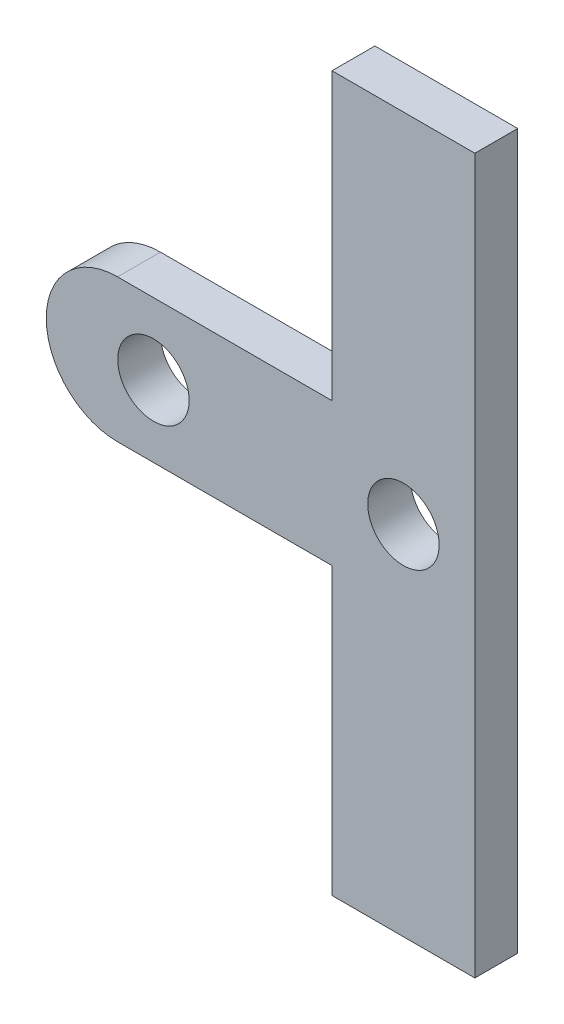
ISO-10303-21;
HEADER;
FILE_DESCRIPTION(('STEP AP214'),'2;1');
FILE_NAME('part.step','',(''),(''),'','','');
FILE_SCHEMA(('AUTOMOTIVE_DESIGN { 1 0 10303 214 1 1 1 1 }'));
ENDSEC;
DATA;
#1=APPLICATION_CONTEXT('core data for automotive mechanical design processes');
#2=APPLICATION_PROTOCOL_DEFINITION('international standard','automotive_design',2000,#1);
#3=PRODUCT_CONTEXT('',#1,'mechanical');
#4=PRODUCT('Part','Part','',(#3));
#5=PRODUCT_RELATED_PRODUCT_CATEGORY('part','',(#4));
#6=PRODUCT_DEFINITION_FORMATION('','',#4);
#7=PRODUCT_DEFINITION_CONTEXT('part definition',#1,'design');
#8=PRODUCT_DEFINITION('design','',#6,#7);
#9=PRODUCT_DEFINITION_SHAPE('','',#8);
#10=(LENGTH_UNIT() NAMED_UNIT(*) SI_UNIT(.MILLI.,.METRE.));
#11=(NAMED_UNIT(*) PLANE_ANGLE_UNIT() SI_UNIT($,.RADIAN.));
#12=(NAMED_UNIT(*) SI_UNIT($,.STERADIAN.) SOLID_ANGLE_UNIT());
#13=UNCERTAINTY_MEASURE_WITH_UNIT(LENGTH_MEASURE(1.E-05),#10,'distance_accuracy_value','');
#14=(GEOMETRIC_REPRESENTATION_CONTEXT(3) GLOBAL_UNCERTAINTY_ASSIGNED_CONTEXT((#13)) GLOBAL_UNIT_ASSIGNED_CONTEXT((#10,
#11,#12)) REPRESENTATION_CONTEXT('',''));
#15=CARTESIAN_POINT('',(0.,0.,0.));
#16=DIRECTION('',(0.,0.,1.));
#17=DIRECTION('',(1.,0.,0.));
#18=AXIS2_PLACEMENT_3D('',#15,#16,#17);
#19=CARTESIAN_POINT('',(-45.3497046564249,4.99,3.));
#20=DIRECTION('',(0.,0.,-1.));
#21=DIRECTION('',(-1.,0.,0.));
#22=AXIS2_PLACEMENT_3D('',#19,#20,#21);
#23=PLANE('',#22);
#24=CARTESIAN_POINT('',(-42.8397046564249,5.,3.));
#25=DIRECTION('',(0.,0.,1.));
#26=DIRECTION('',(1.,0.,0.));
#27=AXIS2_PLACEMENT_3D('',#24,#25,#26);
#28=CIRCLE('',#27,2.5);
#29=CARTESIAN_POINT('',(-40.3397046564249,5.,3.));
#30=VERTEX_POINT('',#29);
#31=EDGE_CURVE('E127',#30,#30,#28,.T.);
#32=ORIENTED_EDGE('',*,*,#31,.F.);
#33=EDGE_LOOP('',(#32));
#34=FACE_BOUND('',#33,.T.);
#35=DIRECTION('',(0.,-1.,0.));
#36=VECTOR('',#35,1.);
#37=CARTESIAN_POINT('',(-30.3397046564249,9.99999999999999,3.));
#38=LINE('',#37,#36);
#39=CARTESIAN_POINT('',(-30.3397046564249,30.,3.));
#40=VERTEX_POINT('',#39);
#41=CARTESIAN_POINT('',(-30.3397046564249,9.99999999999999,3.));
#42=VERTEX_POINT('',#41);
#43=EDGE_CURVE('E149',#40,#42,#38,.T.);
#44=ORIENTED_EDGE('',*,*,#43,.T.);
#45=DIRECTION('',(-1.,0.,0.));
#46=VECTOR('',#45,1.);
#47=CARTESIAN_POINT('',(-45.3497046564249,9.99999999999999,3.));
#48=LINE('',#47,#46);
#49=CARTESIAN_POINT('',(-45.3497046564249,9.99999999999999,3.));
#50=VERTEX_POINT('',#49);
#51=EDGE_CURVE('E122',#42,#50,#48,.T.);
#52=ORIENTED_EDGE('',*,*,#51,.T.);
#53=CARTESIAN_POINT('',(-45.3497046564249,5.00999999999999,3.));
#54=DIRECTION('',(0.,0.,1.));
#55=DIRECTION('',(-1.,0.,0.));
#56=AXIS2_PLACEMENT_3D('',#53,#54,#55);
#57=CIRCLE('',#56,4.99);
#58=CARTESIAN_POINT('',(-50.3397046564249,5.00999999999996,3.));
#59=VERTEX_POINT('',#58);
#60=EDGE_CURVE('E152',#50,#59,#57,.T.);
#61=ORIENTED_EDGE('',*,*,#60,.T.);
#62=DIRECTION('',(0.,-1.,0.));
#63=VECTOR('',#62,1.);
#64=CARTESIAN_POINT('',(-50.3397046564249,4.99000000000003,3.));
#65=LINE('',#64,#63);
#66=CARTESIAN_POINT('',(-50.3397046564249,4.99000000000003,3.));
#67=VERTEX_POINT('',#66);
#68=EDGE_CURVE('E154',#59,#67,#65,.T.);
#69=ORIENTED_EDGE('',*,*,#68,.T.);
#70=CARTESIAN_POINT('',(-45.3497046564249,4.99,3.));
#71=DIRECTION('',(0.,0.,1.));
#72=DIRECTION('',(-1.,0.,0.));
#73=AXIS2_PLACEMENT_3D('',#70,#71,#72);
#74=CIRCLE('',#73,4.99);
#75=CARTESIAN_POINT('',(-45.3497046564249,0.,3.));
#76=VERTEX_POINT('',#75);
#77=EDGE_CURVE('E156',#67,#76,#74,.T.);
#78=ORIENTED_EDGE('',*,*,#77,.T.);
#79=DIRECTION('',(1.,0.,0.));
#80=VECTOR('',#79,1.);
#81=CARTESIAN_POINT('',(-30.3397046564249,0.,3.));
#82=LINE('',#81,#80);
#83=CARTESIAN_POINT('',(-30.3397046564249,0.,3.));
#84=VERTEX_POINT('',#83);
#85=EDGE_CURVE('E158',#76,#84,#82,.T.);
#86=ORIENTED_EDGE('',*,*,#85,.T.);
#87=DIRECTION('',(0.,-1.,0.));
#88=VECTOR('',#87,1.);
#89=CARTESIAN_POINT('',(-30.3397046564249,-20.,3.));
#90=LINE('',#89,#88);
#91=CARTESIAN_POINT('',(-30.3397046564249,-20.,3.));
#92=VERTEX_POINT('',#91);
#93=EDGE_CURVE('E160',#84,#92,#90,.T.);
#94=ORIENTED_EDGE('',*,*,#93,.T.);
#95=DIRECTION('',(1.,0.,0.));
#96=VECTOR('',#95,1.);
#97=CARTESIAN_POINT('',(-20.3397046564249,-20.,3.));
#98=LINE('',#97,#96);
#99=CARTESIAN_POINT('',(-20.3397046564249,-20.,3.));
#100=VERTEX_POINT('',#99);
#101=EDGE_CURVE('E162',#92,#100,#98,.T.);
#102=ORIENTED_EDGE('',*,*,#101,.T.);
#103=DIRECTION('',(0.,1.,0.));
#104=VECTOR('',#103,1.);
#105=CARTESIAN_POINT('',(-20.3397046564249,30.,3.));
#106=LINE('',#105,#104);
#107=CARTESIAN_POINT('',(-20.3397046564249,30.,3.));
#108=VERTEX_POINT('',#107);
#109=EDGE_CURVE('E51',#100,#108,#106,.T.);
#110=ORIENTED_EDGE('',*,*,#109,.T.);
#111=DIRECTION('',(-1.,0.,0.));
#112=VECTOR('',#111,1.);
#113=CARTESIAN_POINT('',(-30.3397046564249,30.,3.));
#114=LINE('',#113,#112);
#115=EDGE_CURVE('E46',#108,#40,#114,.T.);
#116=ORIENTED_EDGE('',*,*,#115,.T.);
#117=EDGE_LOOP('',(#44,#52,#61,#69,#78,#86,#94,#102,#110,#116));
#118=FACE_BOUND('',#117,.T.);
#119=CARTESIAN_POINT('',(-25.3397046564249,5.,3.));
#120=DIRECTION('',(0.,0.,1.));
#121=DIRECTION('',(1.,0.,0.));
#122=AXIS2_PLACEMENT_3D('',#119,#120,#121);
#123=CIRCLE('',#122,2.5);
#124=CARTESIAN_POINT('',(-22.8397046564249,5.,3.));
#125=VERTEX_POINT('',#124);
#126=EDGE_CURVE('E249',#125,#125,#123,.T.);
#127=ORIENTED_EDGE('',*,*,#126,.F.);
#128=EDGE_LOOP('',(#127));
#129=FACE_BOUND('',#128,.T.);
#130=ADVANCED_FACE('F31',(#34,#118,#129),#23,.F.);
#131=CARTESIAN_POINT('',(-45.3497046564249,4.99,0.));
#132=DIRECTION('',(0.,0.,-1.));
#133=DIRECTION('',(-1.,0.,0.));
#134=AXIS2_PLACEMENT_3D('',#131,#132,#133);
#135=PLANE('',#134);
#136=CARTESIAN_POINT('',(-42.8397046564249,5.,0.));
#137=DIRECTION('',(0.,0.,1.));
#138=DIRECTION('',(1.,0.,0.));
#139=AXIS2_PLACEMENT_3D('',#136,#137,#138);
#140=CIRCLE('',#139,2.5);
#141=CARTESIAN_POINT('',(-40.3397046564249,5.,0.));
#142=VERTEX_POINT('',#141);
#143=EDGE_CURVE('E130',#142,#142,#140,.T.);
#144=ORIENTED_EDGE('',*,*,#143,.T.);
#145=EDGE_LOOP('',(#144));
#146=FACE_BOUND('',#145,.T.);
#147=DIRECTION('',(0.,-1.,0.));
#148=VECTOR('',#147,1.);
#149=CARTESIAN_POINT('',(-30.3397046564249,9.99999999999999,0.));
#150=LINE('',#149,#148);
#151=CARTESIAN_POINT('',(-30.3397046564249,30.,0.));
#152=VERTEX_POINT('',#151);
#153=CARTESIAN_POINT('',(-30.3397046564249,9.99999999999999,0.));
#154=VERTEX_POINT('',#153);
#155=EDGE_CURVE('E113',#152,#154,#150,.T.);
#156=ORIENTED_EDGE('',*,*,#155,.F.);
#157=DIRECTION('',(-1.,0.,0.));
#158=VECTOR('',#157,1.);
#159=CARTESIAN_POINT('',(-30.3397046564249,30.,0.));
#160=LINE('',#159,#158);
#161=CARTESIAN_POINT('',(-20.3397046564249,30.,0.));
#162=VERTEX_POINT('',#161);
#163=EDGE_CURVE('E147',#162,#152,#160,.T.);
#164=ORIENTED_EDGE('',*,*,#163,.F.);
#165=DIRECTION('',(0.,1.,0.));
#166=VECTOR('',#165,1.);
#167=CARTESIAN_POINT('',(-20.3397046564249,30.,0.));
#168=LINE('',#167,#166);
#169=CARTESIAN_POINT('',(-20.3397046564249,-20.,0.));
#170=VERTEX_POINT('',#169);
#171=EDGE_CURVE('E145',#170,#162,#168,.T.);
#172=ORIENTED_EDGE('',*,*,#171,.F.);
#173=DIRECTION('',(1.,0.,0.));
#174=VECTOR('',#173,1.);
#175=CARTESIAN_POINT('',(-20.3397046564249,-20.,0.));
#176=LINE('',#175,#174);
#177=CARTESIAN_POINT('',(-30.3397046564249,-20.,0.));
#178=VERTEX_POINT('',#177);
#179=EDGE_CURVE('E143',#178,#170,#176,.T.);
#180=ORIENTED_EDGE('',*,*,#179,.F.);
#181=DIRECTION('',(0.,-1.,0.));
#182=VECTOR('',#181,1.);
#183=CARTESIAN_POINT('',(-30.3397046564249,-20.,0.));
#184=LINE('',#183,#182);
#185=CARTESIAN_POINT('',(-30.3397046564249,0.,0.));
#186=VERTEX_POINT('',#185);
#187=EDGE_CURVE('E141',#186,#178,#184,.T.);
#188=ORIENTED_EDGE('',*,*,#187,.F.);
#189=DIRECTION('',(1.,0.,0.));
#190=VECTOR('',#189,1.);
#191=CARTESIAN_POINT('',(-30.3397046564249,0.,0.));
#192=LINE('',#191,#190);
#193=CARTESIAN_POINT('',(-45.3497046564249,0.,0.));
#194=VERTEX_POINT('',#193);
#195=EDGE_CURVE('E139',#194,#186,#192,.T.);
#196=ORIENTED_EDGE('',*,*,#195,.F.);
#197=CARTESIAN_POINT('',(-45.3497046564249,4.99,0.));
#198=DIRECTION('',(0.,0.,1.));
#199=DIRECTION('',(-1.,0.,0.));
#200=AXIS2_PLACEMENT_3D('',#197,#198,#199);
#201=CIRCLE('',#200,4.99);
#202=CARTESIAN_POINT('',(-50.3397046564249,4.99000000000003,0.));
#203=VERTEX_POINT('',#202);
#204=EDGE_CURVE('E137',#203,#194,#201,.T.);
#205=ORIENTED_EDGE('',*,*,#204,.F.);
#206=DIRECTION('',(0.,-1.,0.));
#207=VECTOR('',#206,1.);
#208=CARTESIAN_POINT('',(-50.3397046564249,4.99000000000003,0.));
#209=LINE('',#208,#207);
#210=CARTESIAN_POINT('',(-50.3397046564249,5.00999999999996,0.));
#211=VERTEX_POINT('',#210);
#212=EDGE_CURVE('E135',#211,#203,#209,.T.);
#213=ORIENTED_EDGE('',*,*,#212,.F.);
#214=CARTESIAN_POINT('',(-45.3497046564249,5.00999999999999,0.));
#215=DIRECTION('',(0.,0.,1.));
#216=DIRECTION('',(-1.,0.,0.));
#217=AXIS2_PLACEMENT_3D('',#214,#215,#216);
#218=CIRCLE('',#217,4.99);
#219=CARTESIAN_POINT('',(-45.3497046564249,9.99999999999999,0.));
#220=VERTEX_POINT('',#219);
#221=EDGE_CURVE('E115',#220,#211,#218,.T.);
#222=ORIENTED_EDGE('',*,*,#221,.F.);
#223=DIRECTION('',(-1.,0.,0.));
#224=VECTOR('',#223,1.);
#225=CARTESIAN_POINT('',(-45.3497046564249,9.99999999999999,0.));
#226=LINE('',#225,#224);
#227=EDGE_CURVE('E108',#154,#220,#226,.T.);
#228=ORIENTED_EDGE('',*,*,#227,.F.);
#229=EDGE_LOOP('',(#156,#164,#172,#180,#188,#196,#205,#213,#222,#228));
#230=FACE_BOUND('',#229,.T.);
#231=CARTESIAN_POINT('',(-25.3397046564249,5.,0.));
#232=DIRECTION('',(0.,0.,1.));
#233=DIRECTION('',(1.,0.,0.));
#234=AXIS2_PLACEMENT_3D('',#231,#232,#233);
#235=CIRCLE('',#234,2.5);
#236=CARTESIAN_POINT('',(-22.8397046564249,5.,0.));
#237=VERTEX_POINT('',#236);
#238=EDGE_CURVE('E252',#237,#237,#235,.T.);
#239=ORIENTED_EDGE('',*,*,#238,.T.);
#240=EDGE_LOOP('',(#239));
#241=FACE_BOUND('',#240,.T.);
#242=ADVANCED_FACE('F109',(#146,#230,#241),#135,.T.);
#243=CARTESIAN_POINT('',(-30.3397046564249,9.99999999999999,3.));
#244=DIRECTION('',(1.,0.,0.));
#245=DIRECTION('',(0.,0.,-1.));
#246=AXIS2_PLACEMENT_3D('',#243,#244,#245);
#247=PLANE('',#246);
#248=ORIENTED_EDGE('',*,*,#155,.T.);
#249=DIRECTION('',(0.,0.,-1.));
#250=VECTOR('',#249,1.);
#251=CARTESIAN_POINT('',(-30.3397046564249,9.99999999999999,3.));
#252=LINE('',#251,#250);
#253=EDGE_CURVE('E11',#42,#154,#252,.T.);
#254=ORIENTED_EDGE('',*,*,#253,.F.);
#255=ORIENTED_EDGE('',*,*,#43,.F.);
#256=DIRECTION('',(0.,0.,-1.));
#257=VECTOR('',#256,1.);
#258=CARTESIAN_POINT('',(-30.3397046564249,30.,3.));
#259=LINE('',#258,#257);
#260=EDGE_CURVE('E126',#40,#152,#259,.T.);
#261=ORIENTED_EDGE('',*,*,#260,.T.);
#262=EDGE_LOOP('',(#248,#254,#255,#261));
#263=FACE_BOUND('',#262,.T.);
#264=ADVANCED_FACE('F33',(#263),#247,.F.);
#265=CARTESIAN_POINT('',(-45.3497046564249,9.99999999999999,3.));
#266=DIRECTION('',(0.,-1.,0.));
#267=DIRECTION('',(1.,0.,0.));
#268=AXIS2_PLACEMENT_3D('',#265,#266,#267);
#269=PLANE('',#268);
#270=ORIENTED_EDGE('',*,*,#227,.T.);
#271=DIRECTION('',(0.,0.,-1.));
#272=VECTOR('',#271,1.);
#273=CARTESIAN_POINT('',(-45.3497046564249,9.99999999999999,3.));
#274=LINE('',#273,#272);
#275=EDGE_CURVE('E39',#50,#220,#274,.T.);
#276=ORIENTED_EDGE('',*,*,#275,.F.);
#277=ORIENTED_EDGE('',*,*,#51,.F.);
#278=ORIENTED_EDGE('',*,*,#253,.T.);
#279=EDGE_LOOP('',(#270,#276,#277,#278));
#280=FACE_BOUND('',#279,.T.);
#281=ADVANCED_FACE('F121',(#280),#269,.F.);
#282=CARTESIAN_POINT('',(-45.3497046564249,5.00999999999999,3.));
#283=DIRECTION('',(0.,0.,-1.));
#284=DIRECTION('',(-1.,0.,0.));
#285=AXIS2_PLACEMENT_3D('',#282,#283,#284);
#286=CYLINDRICAL_SURFACE('',#285,4.99);
#287=ORIENTED_EDGE('',*,*,#221,.T.);
#288=DIRECTION('',(0.,0.,-1.));
#289=VECTOR('',#288,1.);
#290=CARTESIAN_POINT('',(-50.3397046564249,5.00999999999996,3.));
#291=LINE('',#290,#289);
#292=EDGE_CURVE('E185',#59,#211,#291,.T.);
#293=ORIENTED_EDGE('',*,*,#292,.F.);
#294=ORIENTED_EDGE('',*,*,#60,.F.);
#295=ORIENTED_EDGE('',*,*,#275,.T.);
#296=EDGE_LOOP('',(#287,#293,#294,#295));
#297=FACE_BOUND('',#296,.T.);
#298=ADVANCED_FACE('F189',(#297),#286,.T.);
#299=CARTESIAN_POINT('',(-50.3397046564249,4.99000000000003,3.));
#300=DIRECTION('',(1.,0.,0.));
#301=DIRECTION('',(0.,0.,-1.));
#302=AXIS2_PLACEMENT_3D('',#299,#300,#301);
#303=PLANE('',#302);
#304=ORIENTED_EDGE('',*,*,#212,.T.);
#305=DIRECTION('',(0.,0.,-1.));
#306=VECTOR('',#305,1.);
#307=CARTESIAN_POINT('',(-50.3397046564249,4.99000000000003,3.));
#308=LINE('',#307,#306);
#309=EDGE_CURVE('E182',#67,#203,#308,.T.);
#310=ORIENTED_EDGE('',*,*,#309,.F.);
#311=ORIENTED_EDGE('',*,*,#68,.F.);
#312=ORIENTED_EDGE('',*,*,#292,.T.);
#313=EDGE_LOOP('',(#304,#310,#311,#312));
#314=FACE_BOUND('',#313,.T.);
#315=ADVANCED_FACE('F197',(#314),#303,.F.);
#316=CARTESIAN_POINT('',(-45.3497046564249,4.99,3.));
#317=DIRECTION('',(0.,0.,-1.));
#318=DIRECTION('',(-1.,0.,0.));
#319=AXIS2_PLACEMENT_3D('',#316,#317,#318);
#320=CYLINDRICAL_SURFACE('',#319,4.99);
#321=ORIENTED_EDGE('',*,*,#204,.T.);
#322=DIRECTION('',(0.,0.,-1.));
#323=VECTOR('',#322,1.);
#324=CARTESIAN_POINT('',(-45.3497046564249,0.,3.));
#325=LINE('',#324,#323);
#326=EDGE_CURVE('E179',#76,#194,#325,.T.);
#327=ORIENTED_EDGE('',*,*,#326,.F.);
#328=ORIENTED_EDGE('',*,*,#77,.F.);
#329=ORIENTED_EDGE('',*,*,#309,.T.);
#330=EDGE_LOOP('',(#321,#327,#328,#329));
#331=FACE_BOUND('',#330,.T.);
#332=ADVANCED_FACE('F200',(#331),#320,.T.);
#333=CARTESIAN_POINT('',(-30.3397046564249,0.,3.));
#334=DIRECTION('',(0.,1.,0.));
#335=DIRECTION('',(-1.,0.,0.));
#336=AXIS2_PLACEMENT_3D('',#333,#334,#335);
#337=PLANE('',#336);
#338=ORIENTED_EDGE('',*,*,#195,.T.);
#339=DIRECTION('',(0.,0.,-1.));
#340=VECTOR('',#339,1.);
#341=CARTESIAN_POINT('',(-30.3397046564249,0.,3.));
#342=LINE('',#341,#340);
#343=EDGE_CURVE('E176',#84,#186,#342,.T.);
#344=ORIENTED_EDGE('',*,*,#343,.F.);
#345=ORIENTED_EDGE('',*,*,#85,.F.);
#346=ORIENTED_EDGE('',*,*,#326,.T.);
#347=EDGE_LOOP('',(#338,#344,#345,#346));
#348=FACE_BOUND('',#347,.T.);
#349=ADVANCED_FACE('F205',(#348),#337,.F.);
#350=CARTESIAN_POINT('',(-30.3397046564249,-20.,3.));
#351=DIRECTION('',(1.,0.,0.));
#352=DIRECTION('',(0.,0.,-1.));
#353=AXIS2_PLACEMENT_3D('',#350,#351,#352);
#354=PLANE('',#353);
#355=ORIENTED_EDGE('',*,*,#187,.T.);
#356=DIRECTION('',(0.,0.,-1.));
#357=VECTOR('',#356,1.);
#358=CARTESIAN_POINT('',(-30.3397046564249,-20.,3.));
#359=LINE('',#358,#357);
#360=EDGE_CURVE('E173',#92,#178,#359,.T.);
#361=ORIENTED_EDGE('',*,*,#360,.F.);
#362=ORIENTED_EDGE('',*,*,#93,.F.);
#363=ORIENTED_EDGE('',*,*,#343,.T.);
#364=EDGE_LOOP('',(#355,#361,#362,#363));
#365=FACE_BOUND('',#364,.T.);
#366=ADVANCED_FACE('F211',(#365),#354,.F.);
#367=CARTESIAN_POINT('',(-20.3397046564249,-20.,3.));
#368=DIRECTION('',(0.,1.,0.));
#369=DIRECTION('',(0.,0.,1.));
#370=AXIS2_PLACEMENT_3D('',#367,#368,#369);
#371=PLANE('',#370);
#372=ORIENTED_EDGE('',*,*,#179,.T.);
#373=DIRECTION('',(0.,0.,-1.));
#374=VECTOR('',#373,1.);
#375=CARTESIAN_POINT('',(-20.3397046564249,-20.,3.));
#376=LINE('',#375,#374);
#377=EDGE_CURVE('E170',#100,#170,#376,.T.);
#378=ORIENTED_EDGE('',*,*,#377,.F.);
#379=ORIENTED_EDGE('',*,*,#101,.F.);
#380=ORIENTED_EDGE('',*,*,#360,.T.);
#381=EDGE_LOOP('',(#372,#378,#379,#380));
#382=FACE_BOUND('',#381,.T.);
#383=ADVANCED_FACE('F215',(#382),#371,.F.);
#384=CARTESIAN_POINT('',(-20.3397046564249,30.,3.));
#385=DIRECTION('',(-1.,0.,0.));
#386=DIRECTION('',(0.,-1.,0.));
#387=AXIS2_PLACEMENT_3D('',#384,#385,#386);
#388=PLANE('',#387);
#389=ORIENTED_EDGE('',*,*,#171,.T.);
#390=DIRECTION('',(0.,0.,-1.));
#391=VECTOR('',#390,1.);
#392=CARTESIAN_POINT('',(-20.3397046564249,30.,3.));
#393=LINE('',#392,#391);
#394=EDGE_CURVE('E167',#108,#162,#393,.T.);
#395=ORIENTED_EDGE('',*,*,#394,.F.);
#396=ORIENTED_EDGE('',*,*,#109,.F.);
#397=ORIENTED_EDGE('',*,*,#377,.T.);
#398=EDGE_LOOP('',(#389,#395,#396,#397));
#399=FACE_BOUND('',#398,.T.);
#400=ADVANCED_FACE('F218',(#399),#388,.F.);
#401=CARTESIAN_POINT('',(-30.3397046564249,30.,3.));
#402=DIRECTION('',(0.,-1.,0.));
#403=DIRECTION('',(0.,0.,-1.));
#404=AXIS2_PLACEMENT_3D('',#401,#402,#403);
#405=PLANE('',#404);
#406=ORIENTED_EDGE('',*,*,#163,.T.);
#407=ORIENTED_EDGE('',*,*,#260,.F.);
#408=ORIENTED_EDGE('',*,*,#115,.F.);
#409=ORIENTED_EDGE('',*,*,#394,.T.);
#410=EDGE_LOOP('',(#406,#407,#408,#409));
#411=FACE_BOUND('',#410,.T.);
#412=ADVANCED_FACE('F220',(#411),#405,.F.);
#413=CARTESIAN_POINT('',(-42.8397046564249,5.,3.));
#414=DIRECTION('',(0.,0.,-1.));
#415=DIRECTION('',(-1.,0.,0.));
#416=AXIS2_PLACEMENT_3D('',#413,#414,#415);
#417=CYLINDRICAL_SURFACE('',#416,2.5);
#418=ORIENTED_EDGE('',*,*,#31,.T.);
#419=EDGE_LOOP('',(#418));
#420=FACE_BOUND('',#419,.T.);
#421=ORIENTED_EDGE('',*,*,#143,.F.);
#422=EDGE_LOOP('',(#421));
#423=FACE_BOUND('',#422,.T.);
#424=ADVANCED_FACE('F222',(#420,#423),#417,.F.);
#425=CARTESIAN_POINT('',(-25.3397046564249,5.,3.));
#426=DIRECTION('',(0.,0.,-1.));
#427=DIRECTION('',(-1.,0.,0.));
#428=AXIS2_PLACEMENT_3D('',#425,#426,#427);
#429=CYLINDRICAL_SURFACE('',#428,2.5);
#430=ORIENTED_EDGE('',*,*,#126,.T.);
#431=EDGE_LOOP('',(#430));
#432=FACE_BOUND('',#431,.T.);
#433=ORIENTED_EDGE('',*,*,#238,.F.);
#434=EDGE_LOOP('',(#433));
#435=FACE_BOUND('',#434,.T.);
#436=ADVANCED_FACE('F228',(#432,#435),#429,.F.);
#437=CLOSED_SHELL('',(#130,#242,#264,#281,#298,#315,#332,#349,#366,#383,#400,#412,#424,#436));
#438=MANIFOLD_SOLID_BREP('B2',#437);
#439=ADVANCED_BREP_SHAPE_REPRESENTATION('',(#18,#438),#14);
#440=SHAPE_DEFINITION_REPRESENTATION(#9,#439);
ENDSEC;
END-ISO-10303-21;
